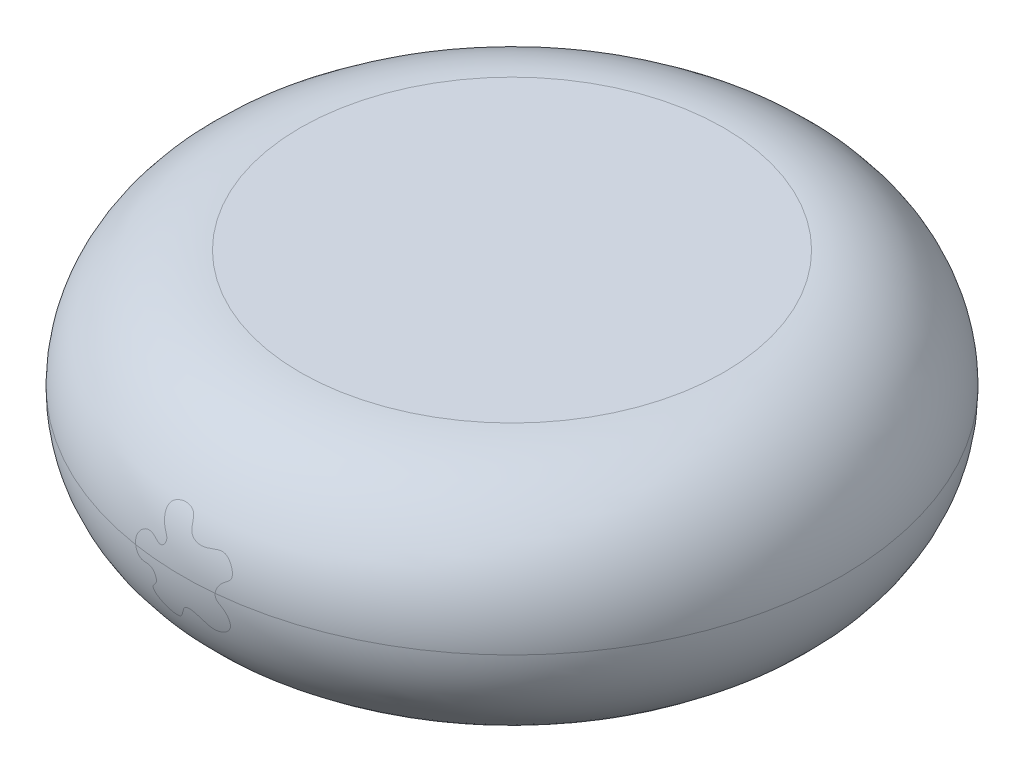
from build123d import *


with BuildPart() as part:
    # Sketch1 → Revolve1 (revolve)
    with BuildSketch(Plane.XY, mode=Mode.PRIVATE) as revolve1_sk:
        with BuildLine():
            Line((22.5, 12.5), (0, 12.5))
            Line((0, 12.5), (0, -12.5))
            Line((0, -12.5), (22.5, -12.5))
            ThreePointArc((22.5, -12.5), (35, 0), (22.5, 12.5))
        make_face()
    revolve(revolve1_sk.sketch.rotate(Axis((0, 0, 0), (0, 1, 0)), 90), axis=Axis((0, 0, 0), (0, 1, 0)))


solid = part.part
